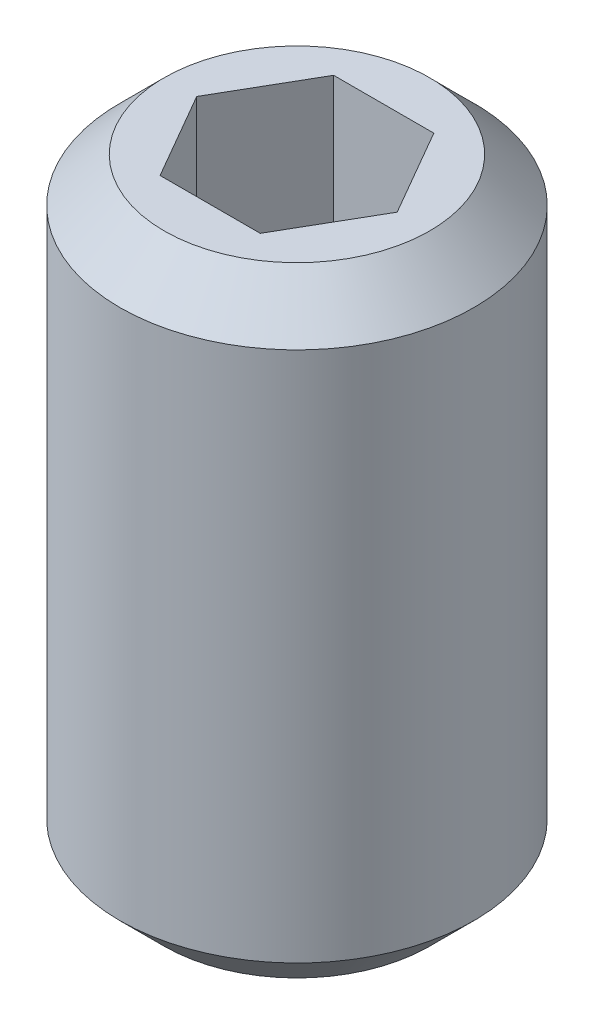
ISO-10303-21;
HEADER;
FILE_DESCRIPTION(('STEP AP214'),'2;1');
FILE_NAME('part.step','',(''),(''),'','','');
FILE_SCHEMA(('AUTOMOTIVE_DESIGN { 1 0 10303 214 1 1 1 1 }'));
ENDSEC;
DATA;
#1=APPLICATION_CONTEXT('core data for automotive mechanical design processes');
#2=APPLICATION_PROTOCOL_DEFINITION('international standard','automotive_design',2000,#1);
#3=PRODUCT_CONTEXT('',#1,'mechanical');
#4=PRODUCT('Part','Part','',(#3));
#5=PRODUCT_RELATED_PRODUCT_CATEGORY('part','',(#4));
#6=PRODUCT_DEFINITION_FORMATION('','',#4);
#7=PRODUCT_DEFINITION_CONTEXT('part definition',#1,'design');
#8=PRODUCT_DEFINITION('design','',#6,#7);
#9=PRODUCT_DEFINITION_SHAPE('','',#8);
#10=(LENGTH_UNIT() NAMED_UNIT(*) SI_UNIT(.MILLI.,.METRE.));
#11=(NAMED_UNIT(*) PLANE_ANGLE_UNIT() SI_UNIT($,.RADIAN.));
#12=(NAMED_UNIT(*) SI_UNIT($,.STERADIAN.) SOLID_ANGLE_UNIT());
#13=UNCERTAINTY_MEASURE_WITH_UNIT(LENGTH_MEASURE(1.E-05),#10,'distance_accuracy_value','');
#14=(GEOMETRIC_REPRESENTATION_CONTEXT(3) GLOBAL_UNCERTAINTY_ASSIGNED_CONTEXT((#13)) GLOBAL_UNIT_ASSIGNED_CONTEXT((#10,
#11,#12)) REPRESENTATION_CONTEXT('',''));
#15=CARTESIAN_POINT('',(0.,0.,0.));
#16=DIRECTION('',(0.,0.,1.));
#17=DIRECTION('',(1.,0.,0.));
#18=AXIS2_PLACEMENT_3D('',#15,#16,#17);
#19=CARTESIAN_POINT('',(0.,7.,0.));
#20=DIRECTION('',(0.,-1.,0.));
#21=DIRECTION('',(0.,0.,-1.));
#22=AXIS2_PLACEMENT_3D('',#19,#20,#21);
#23=CYLINDRICAL_SURFACE('',#22,2.);
#24=CARTESIAN_POINT('',(0.,0.5,0.));
#25=DIRECTION('',(0.,1.,0.));
#26=DIRECTION('',(0.,0.,1.));
#27=AXIS2_PLACEMENT_3D('',#24,#25,#26);
#28=CIRCLE('',#27,2.);
#29=CARTESIAN_POINT('',(0.,0.5,2.));
#30=VERTEX_POINT('',#29);
#31=EDGE_CURVE('E39',#30,#30,#28,.T.);
#32=ORIENTED_EDGE('',*,*,#31,.T.);
#33=EDGE_LOOP('',(#32));
#34=FACE_BOUND('',#33,.T.);
#35=CARTESIAN_POINT('',(0.,6.5,0.));
#36=DIRECTION('',(0.,1.,0.));
#37=DIRECTION('',(0.,0.,1.));
#38=AXIS2_PLACEMENT_3D('',#35,#36,#37);
#39=CIRCLE('',#38,2.);
#40=CARTESIAN_POINT('',(0.,6.5,2.));
#41=VERTEX_POINT('',#40);
#42=EDGE_CURVE('E142',#41,#41,#39,.F.);
#43=ORIENTED_EDGE('',*,*,#42,.T.);
#44=EDGE_LOOP('',(#43));
#45=FACE_BOUND('',#44,.T.);
#46=ADVANCED_FACE('F32',(#34,#45),#23,.T.);
#47=CARTESIAN_POINT('',(0.,7.,0.));
#48=DIRECTION('',(0.,1.,0.));
#49=DIRECTION('',(0.,0.,1.));
#50=AXIS2_PLACEMENT_3D('',#47,#48,#49);
#51=PLANE('',#50);
#52=CARTESIAN_POINT('',(0.,7.,0.));
#53=DIRECTION('',(0.,1.,0.));
#54=DIRECTION('',(0.,0.,1.));
#55=AXIS2_PLACEMENT_3D('',#52,#53,#54);
#56=CIRCLE('',#55,1.5);
#57=CARTESIAN_POINT('',(0.,7.,1.5));
#58=VERTEX_POINT('',#57);
#59=EDGE_CURVE('E133',#58,#58,#56,.T.);
#60=ORIENTED_EDGE('',*,*,#59,.T.);
#61=EDGE_LOOP('',(#60));
#62=FACE_BOUND('',#61,.T.);
#63=DIRECTION('',(0.499999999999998,0.,0.86602540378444));
#64=VECTOR('',#63,1.);
#65=CARTESIAN_POINT('',(-0.566157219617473,7.,0.980613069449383));
#66=LINE('',#65,#64);
#67=CARTESIAN_POINT('',(-1.13231443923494,7.,0.));
#68=VERTEX_POINT('',#67);
#69=CARTESIAN_POINT('',(-0.566157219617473,7.,0.980613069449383));
#70=VERTEX_POINT('',#69);
#71=EDGE_CURVE('E46',#68,#70,#66,.T.);
#72=ORIENTED_EDGE('',*,*,#71,.F.);
#73=DIRECTION('',(-0.500000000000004,0.,0.866025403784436));
#74=VECTOR('',#73,1.);
#75=CARTESIAN_POINT('',(-1.13231443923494,7.,0.));
#76=LINE('',#75,#74);
#77=CARTESIAN_POINT('',(-0.566157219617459,7.,-0.980613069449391));
#78=VERTEX_POINT('',#77);
#79=EDGE_CURVE('E115',#78,#68,#76,.T.);
#80=ORIENTED_EDGE('',*,*,#79,.F.);
#81=DIRECTION('',(-1.,0.,0.));
#82=VECTOR('',#81,1.);
#83=CARTESIAN_POINT('',(-0.566157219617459,7.,-0.980613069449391));
#84=LINE('',#83,#82);
#85=CARTESIAN_POINT('',(0.566157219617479,7.,-0.980613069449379));
#86=VERTEX_POINT('',#85);
#87=EDGE_CURVE('E109',#86,#78,#84,.T.);
#88=ORIENTED_EDGE('',*,*,#87,.F.);
#89=DIRECTION('',(-0.499999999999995,0.,-0.866025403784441));
#90=VECTOR('',#89,1.);
#91=CARTESIAN_POINT('',(0.566157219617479,7.,-0.980613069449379));
#92=LINE('',#91,#90);
#93=CARTESIAN_POINT('',(1.13231443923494,7.,0.));
#94=VERTEX_POINT('',#93);
#95=EDGE_CURVE('E107',#94,#86,#92,.T.);
#96=ORIENTED_EDGE('',*,*,#95,.F.);
#97=DIRECTION('',(0.500000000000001,0.,-0.866025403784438));
#98=VECTOR('',#97,1.);
#99=CARTESIAN_POINT('',(1.13231443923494,7.,0.));
#100=LINE('',#99,#98);
#101=CARTESIAN_POINT('',(0.566157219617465,7.,0.980613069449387));
#102=VERTEX_POINT('',#101);
#103=EDGE_CURVE('E89',#102,#94,#100,.T.);
#104=ORIENTED_EDGE('',*,*,#103,.F.);
#105=DIRECTION('',(1.,0.,0.));
#106=VECTOR('',#105,1.);
#107=CARTESIAN_POINT('',(0.566157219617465,7.,0.980613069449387));
#108=LINE('',#107,#106);
#109=EDGE_CURVE('E100',#70,#102,#108,.T.);
#110=ORIENTED_EDGE('',*,*,#109,.F.);
#111=EDGE_LOOP('',(#72,#80,#88,#96,#104,#110));
#112=FACE_BOUND('',#111,.T.);
#113=ADVANCED_FACE('F104',(#62,#112),#51,.T.);
#114=CARTESIAN_POINT('',(0.,0.,0.));
#115=DIRECTION('',(0.,1.,0.));
#116=DIRECTION('',(0.,0.,1.));
#117=AXIS2_PLACEMENT_3D('',#114,#115,#116);
#118=PLANE('',#117);
#119=CARTESIAN_POINT('',(0.,0.,0.));
#120=DIRECTION('',(0.,1.,0.));
#121=DIRECTION('',(0.,0.,1.));
#122=AXIS2_PLACEMENT_3D('',#119,#120,#121);
#123=CIRCLE('',#122,1.5);
#124=CARTESIAN_POINT('',(0.,0.,1.5));
#125=VERTEX_POINT('',#124);
#126=EDGE_CURVE('E11',#125,#125,#123,.F.);
#127=ORIENTED_EDGE('',*,*,#126,.T.);
#128=EDGE_LOOP('',(#127));
#129=FACE_BOUND('',#128,.T.);
#130=ADVANCED_FACE('F165',(#129),#118,.F.);
#131=CARTESIAN_POINT('',(-0.566157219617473,4.,0.980613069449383));
#132=DIRECTION('',(-0.86602540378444,0.,0.499999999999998));
#133=DIRECTION('',(0.499999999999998,0.,0.86602540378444));
#134=AXIS2_PLACEMENT_3D('',#131,#132,#133);
#135=PLANE('',#134);
#136=ORIENTED_EDGE('',*,*,#71,.T.);
#137=DIRECTION('',(0.,1.,0.));
#138=VECTOR('',#137,1.);
#139=CARTESIAN_POINT('',(-0.566157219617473,4.,0.980613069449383));
#140=LINE('',#139,#138);
#141=CARTESIAN_POINT('',(-0.566157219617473,4.,0.980613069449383));
#142=VERTEX_POINT('',#141);
#143=EDGE_CURVE('E97',#142,#70,#140,.T.);
#144=ORIENTED_EDGE('',*,*,#143,.F.);
#145=DIRECTION('',(0.499999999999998,0.,0.86602540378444));
#146=VECTOR('',#145,1.);
#147=CARTESIAN_POINT('',(-0.566157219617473,4.,0.980613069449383));
#148=LINE('',#147,#146);
#149=CARTESIAN_POINT('',(-1.13231443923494,4.,0.));
#150=VERTEX_POINT('',#149);
#151=EDGE_CURVE('E117',#150,#142,#148,.T.);
#152=ORIENTED_EDGE('',*,*,#151,.F.);
#153=DIRECTION('',(0.,1.,0.));
#154=VECTOR('',#153,1.);
#155=CARTESIAN_POINT('',(-1.13231443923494,4.,0.));
#156=LINE('',#155,#154);
#157=EDGE_CURVE('E53',#150,#68,#156,.T.);
#158=ORIENTED_EDGE('',*,*,#157,.T.);
#159=EDGE_LOOP('',(#136,#144,#152,#158));
#160=FACE_BOUND('',#159,.T.);
#161=ADVANCED_FACE('F170',(#160),#135,.F.);
#162=CARTESIAN_POINT('',(-1.13231443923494,4.,0.));
#163=DIRECTION('',(-0.866025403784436,0.,-0.500000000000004));
#164=DIRECTION('',(-0.500000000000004,0.,0.866025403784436));
#165=AXIS2_PLACEMENT_3D('',#162,#163,#164);
#166=PLANE('',#165);
#167=ORIENTED_EDGE('',*,*,#79,.T.);
#168=ORIENTED_EDGE('',*,*,#157,.F.);
#169=DIRECTION('',(-0.500000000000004,0.,0.866025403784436));
#170=VECTOR('',#169,1.);
#171=CARTESIAN_POINT('',(-1.13231443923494,4.,0.));
#172=LINE('',#171,#170);
#173=CARTESIAN_POINT('',(-0.566157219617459,4.,-0.980613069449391));
#174=VERTEX_POINT('',#173);
#175=EDGE_CURVE('E129',#174,#150,#172,.T.);
#176=ORIENTED_EDGE('',*,*,#175,.F.);
#177=DIRECTION('',(0.,1.,0.));
#178=VECTOR('',#177,1.);
#179=CARTESIAN_POINT('',(-0.566157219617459,4.,-0.980613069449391));
#180=LINE('',#179,#178);
#181=EDGE_CURVE('E134',#174,#78,#180,.T.);
#182=ORIENTED_EDGE('',*,*,#181,.T.);
#183=EDGE_LOOP('',(#167,#168,#176,#182));
#184=FACE_BOUND('',#183,.T.);
#185=ADVANCED_FACE('F176',(#184),#166,.F.);
#186=CARTESIAN_POINT('',(-0.566157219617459,4.,-0.980613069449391));
#187=DIRECTION('',(0.,0.,-1.));
#188=DIRECTION('',(-1.,0.,0.));
#189=AXIS2_PLACEMENT_3D('',#186,#187,#188);
#190=PLANE('',#189);
#191=ORIENTED_EDGE('',*,*,#87,.T.);
#192=ORIENTED_EDGE('',*,*,#181,.F.);
#193=DIRECTION('',(-1.,0.,0.));
#194=VECTOR('',#193,1.);
#195=CARTESIAN_POINT('',(-0.566157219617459,4.,-0.980613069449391));
#196=LINE('',#195,#194);
#197=CARTESIAN_POINT('',(0.566157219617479,4.,-0.980613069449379));
#198=VERTEX_POINT('',#197);
#199=EDGE_CURVE('E126',#198,#174,#196,.T.);
#200=ORIENTED_EDGE('',*,*,#199,.F.);
#201=DIRECTION('',(0.,1.,0.));
#202=VECTOR('',#201,1.);
#203=CARTESIAN_POINT('',(0.566157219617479,4.,-0.980613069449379));
#204=LINE('',#203,#202);
#205=EDGE_CURVE('E136',#198,#86,#204,.T.);
#206=ORIENTED_EDGE('',*,*,#205,.T.);
#207=EDGE_LOOP('',(#191,#192,#200,#206));
#208=FACE_BOUND('',#207,.T.);
#209=ADVANCED_FACE('F184',(#208),#190,.F.);
#210=CARTESIAN_POINT('',(0.566157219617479,4.,-0.980613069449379));
#211=DIRECTION('',(0.866025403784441,0.,-0.499999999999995));
#212=DIRECTION('',(-0.499999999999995,0.,-0.866025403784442));
#213=AXIS2_PLACEMENT_3D('',#210,#211,#212);
#214=PLANE('',#213);
#215=ORIENTED_EDGE('',*,*,#95,.T.);
#216=ORIENTED_EDGE('',*,*,#205,.F.);
#217=DIRECTION('',(-0.499999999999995,0.,-0.866025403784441));
#218=VECTOR('',#217,1.);
#219=CARTESIAN_POINT('',(0.566157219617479,4.,-0.980613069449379));
#220=LINE('',#219,#218);
#221=CARTESIAN_POINT('',(1.13231443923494,4.,0.));
#222=VERTEX_POINT('',#221);
#223=EDGE_CURVE('E123',#222,#198,#220,.T.);
#224=ORIENTED_EDGE('',*,*,#223,.F.);
#225=DIRECTION('',(0.,1.,0.));
#226=VECTOR('',#225,1.);
#227=CARTESIAN_POINT('',(1.13231443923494,4.,0.));
#228=LINE('',#227,#226);
#229=EDGE_CURVE('E96',#222,#94,#228,.T.);
#230=ORIENTED_EDGE('',*,*,#229,.T.);
#231=EDGE_LOOP('',(#215,#216,#224,#230));
#232=FACE_BOUND('',#231,.T.);
#233=ADVANCED_FACE('F181',(#232),#214,.F.);
#234=CARTESIAN_POINT('',(1.13231443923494,4.,0.));
#235=DIRECTION('',(0.866025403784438,0.,0.500000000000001));
#236=DIRECTION('',(0.500000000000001,0.,-0.866025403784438));
#237=AXIS2_PLACEMENT_3D('',#234,#235,#236);
#238=PLANE('',#237);
#239=ORIENTED_EDGE('',*,*,#103,.T.);
#240=ORIENTED_EDGE('',*,*,#229,.F.);
#241=DIRECTION('',(0.500000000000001,0.,-0.866025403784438));
#242=VECTOR('',#241,1.);
#243=CARTESIAN_POINT('',(1.13231443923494,4.,0.));
#244=LINE('',#243,#242);
#245=CARTESIAN_POINT('',(0.566157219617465,4.,0.980613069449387));
#246=VERTEX_POINT('',#245);
#247=EDGE_CURVE('E92',#246,#222,#244,.T.);
#248=ORIENTED_EDGE('',*,*,#247,.F.);
#249=DIRECTION('',(0.,1.,0.));
#250=VECTOR('',#249,1.);
#251=CARTESIAN_POINT('',(0.566157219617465,4.,0.980613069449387));
#252=LINE('',#251,#250);
#253=EDGE_CURVE('E85',#246,#102,#252,.T.);
#254=ORIENTED_EDGE('',*,*,#253,.T.);
#255=EDGE_LOOP('',(#239,#240,#248,#254));
#256=FACE_BOUND('',#255,.T.);
#257=ADVANCED_FACE('F87',(#256),#238,.F.);
#258=CARTESIAN_POINT('',(0.566157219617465,4.,0.980613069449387));
#259=DIRECTION('',(0.,0.,1.));
#260=DIRECTION('',(1.,0.,0.));
#261=AXIS2_PLACEMENT_3D('',#258,#259,#260);
#262=PLANE('',#261);
#263=ORIENTED_EDGE('',*,*,#109,.T.);
#264=ORIENTED_EDGE('',*,*,#253,.F.);
#265=DIRECTION('',(1.,0.,0.));
#266=VECTOR('',#265,1.);
#267=CARTESIAN_POINT('',(0.566157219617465,4.,0.980613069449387));
#268=LINE('',#267,#266);
#269=EDGE_CURVE('E120',#142,#246,#268,.T.);
#270=ORIENTED_EDGE('',*,*,#269,.F.);
#271=ORIENTED_EDGE('',*,*,#143,.T.);
#272=EDGE_LOOP('',(#263,#264,#270,#271));
#273=FACE_BOUND('',#272,.T.);
#274=ADVANCED_FACE('F101',(#273),#262,.F.);
#275=CARTESIAN_POINT('',(-1.13231443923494,4.,0.));
#276=DIRECTION('',(0.,-1.,0.));
#277=DIRECTION('',(0.,0.,-1.));
#278=AXIS2_PLACEMENT_3D('',#275,#276,#277);
#279=PLANE('',#278);
#280=ORIENTED_EDGE('',*,*,#151,.T.);
#281=ORIENTED_EDGE('',*,*,#269,.T.);
#282=ORIENTED_EDGE('',*,*,#247,.T.);
#283=ORIENTED_EDGE('',*,*,#223,.T.);
#284=ORIENTED_EDGE('',*,*,#199,.T.);
#285=ORIENTED_EDGE('',*,*,#175,.T.);
#286=EDGE_LOOP('',(#280,#281,#282,#283,#284,#285));
#287=FACE_BOUND('',#286,.T.);
#288=ADVANCED_FACE('F157',(#287),#279,.F.);
#289=CARTESIAN_POINT('',(0.,7.,0.));
#290=DIRECTION('',(0.,-1.,0.));
#291=DIRECTION('',(0.,0.,-1.));
#292=AXIS2_PLACEMENT_3D('',#289,#290,#291);
#293=CONICAL_SURFACE('',#292,1.5,0.785398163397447);
#294=ORIENTED_EDGE('',*,*,#42,.F.);
#295=EDGE_LOOP('',(#294));
#296=FACE_BOUND('',#295,.T.);
#297=ORIENTED_EDGE('',*,*,#59,.F.);
#298=EDGE_LOOP('',(#297));
#299=FACE_BOUND('',#298,.T.);
#300=ADVANCED_FACE('F151',(#296,#299),#293,.T.);
#301=CARTESIAN_POINT('',(0.,0.5,0.));
#302=DIRECTION('',(0.,1.,0.));
#303=DIRECTION('',(0.,0.,1.));
#304=AXIS2_PLACEMENT_3D('',#301,#302,#303);
#305=CONICAL_SURFACE('',#304,2.,0.78539816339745);
#306=ORIENTED_EDGE('',*,*,#126,.F.);
#307=EDGE_LOOP('',(#306));
#308=FACE_BOUND('',#307,.T.);
#309=ORIENTED_EDGE('',*,*,#31,.F.);
#310=EDGE_LOOP('',(#309));
#311=FACE_BOUND('',#310,.T.);
#312=ADVANCED_FACE('F149',(#308,#311),#305,.T.);
#313=CLOSED_SHELL('',(#46,#113,#130,#161,#185,#209,#233,#257,#274,#288,#300,#312));
#314=MANIFOLD_SOLID_BREP('B2',#313);
#315=ADVANCED_BREP_SHAPE_REPRESENTATION('',(#18,#314),#14);
#316=SHAPE_DEFINITION_REPRESENTATION(#9,#315);
ENDSEC;
END-ISO-10303-21;
